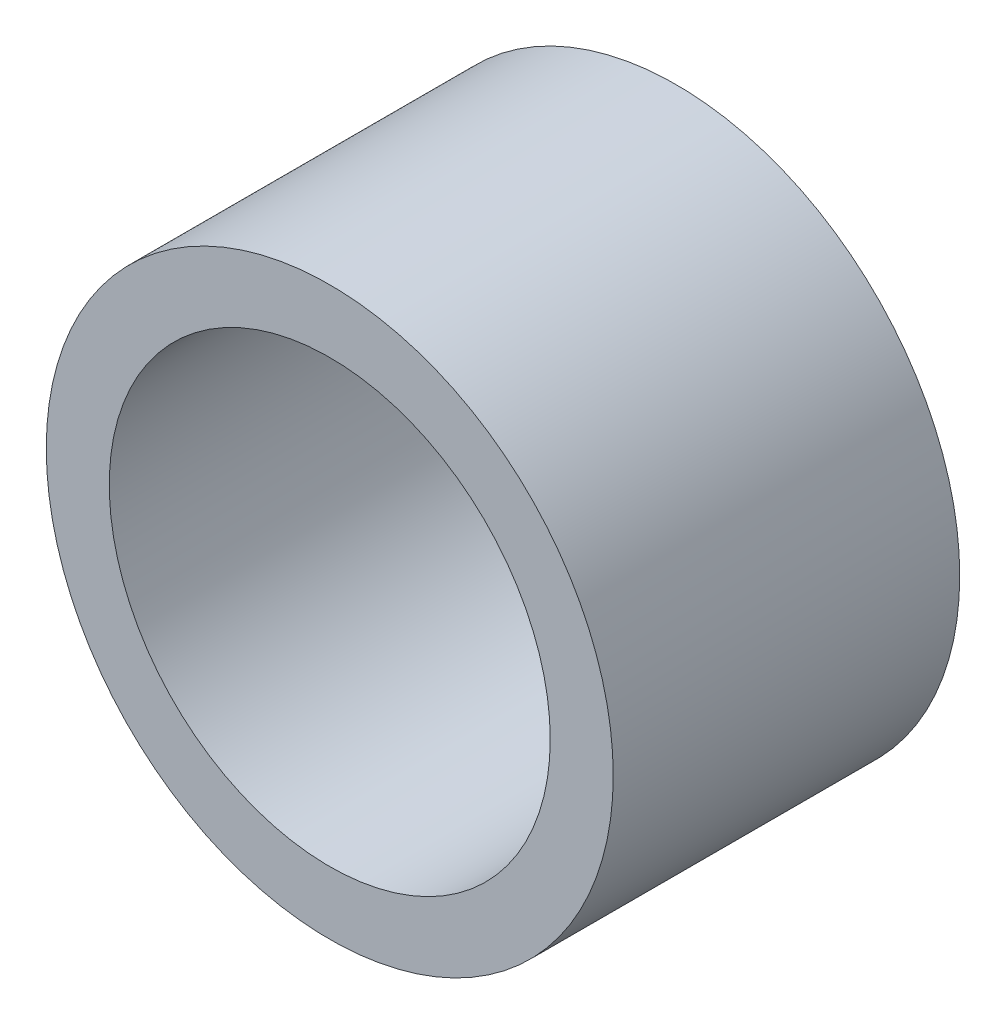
from build123d import *

# Parameters (mm, degrees)
SKETCH1_R      = 18
SKETCH1_R_2    = 14
EXTRUDE1_DEPTH = 22


with BuildPart() as part:
    # Sketch1 → Extrude1 (new body)
    with BuildSketch(Plane.XY):
        Circle(SKETCH1_R)
        Circle(SKETCH1_R_2, mode=Mode.SUBTRACT)
    extrude(amount=EXTRUDE1_DEPTH)


solid = part.part
